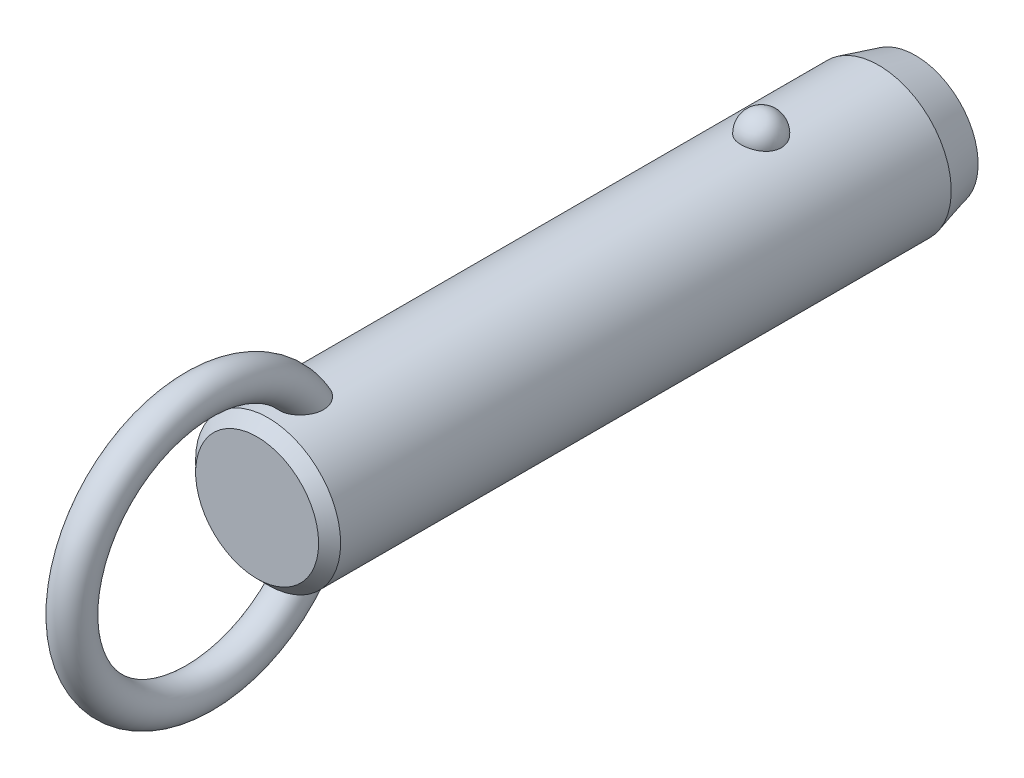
ISO-10303-21;
HEADER;
FILE_DESCRIPTION(('STEP AP214'),'2;1');
FILE_NAME('part.step','',(''),(''),'','','');
FILE_SCHEMA(('AUTOMOTIVE_DESIGN { 1 0 10303 214 1 1 1 1 }'));
ENDSEC;
DATA;
#1=APPLICATION_CONTEXT('core data for automotive mechanical design processes');
#2=APPLICATION_PROTOCOL_DEFINITION('international standard','automotive_design',2000,#1);
#3=PRODUCT_CONTEXT('',#1,'mechanical');
#4=PRODUCT('Part','Part','',(#3));
#5=PRODUCT_RELATED_PRODUCT_CATEGORY('part','',(#4));
#6=PRODUCT_DEFINITION_FORMATION('','',#4);
#7=PRODUCT_DEFINITION_CONTEXT('part definition',#1,'design');
#8=PRODUCT_DEFINITION('design','',#6,#7);
#9=PRODUCT_DEFINITION_SHAPE('','',#8);
#10=(LENGTH_UNIT() NAMED_UNIT(*) SI_UNIT(.MILLI.,.METRE.));
#11=(NAMED_UNIT(*) PLANE_ANGLE_UNIT() SI_UNIT($,.RADIAN.));
#12=(NAMED_UNIT(*) SI_UNIT($,.STERADIAN.) SOLID_ANGLE_UNIT());
#13=UNCERTAINTY_MEASURE_WITH_UNIT(LENGTH_MEASURE(1.E-05),#10,'distance_accuracy_value','');
#14=(GEOMETRIC_REPRESENTATION_CONTEXT(3) GLOBAL_UNCERTAINTY_ASSIGNED_CONTEXT((#13)) GLOBAL_UNIT_ASSIGNED_CONTEXT((#10,
#11,#12)) REPRESENTATION_CONTEXT('',''));
#15=CARTESIAN_POINT('',(0.,0.,0.));
#16=DIRECTION('',(0.,0.,1.));
#17=DIRECTION('',(1.,0.,0.));
#18=AXIS2_PLACEMENT_3D('',#15,#16,#17);
#19=CARTESIAN_POINT('',(0.,0.,43.2));
#20=DIRECTION('',(0.,0.,-1.));
#21=DIRECTION('',(-1.,0.,0.));
#22=AXIS2_PLACEMENT_3D('',#19,#20,#21);
#23=CYLINDRICAL_SURFACE('',#22,7.9);
#24=CARTESIAN_POINT('',(2.1785689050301,7.59367088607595,-2.2));
#25=CARTESIAN_POINT('',(2.17856679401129,7.59367269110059,-2.07701843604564));
#26=CARTESIAN_POINT('',(2.16853481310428,7.59657145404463,-1.95401006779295));
#27=CARTESIAN_POINT('',(2.12864689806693,7.607843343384,-1.71147811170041));
#28=CARTESIAN_POINT('',(2.09878338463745,7.61621856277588,-1.59195587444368));
#29=CARTESIAN_POINT('',(2.0199931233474,7.63749180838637,-1.35985638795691));
#30=CARTESIAN_POINT('',(1.97107475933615,7.6503878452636,-1.24727610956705));
#31=CARTESIAN_POINT('',(1.85539377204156,7.67926115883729,-1.03213234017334));
#32=CARTESIAN_POINT('',(1.78863158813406,7.69523835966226,-0.929568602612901));
#33=CARTESIAN_POINT('',(1.63856494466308,7.7285848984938,-0.736786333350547));
#34=CARTESIAN_POINT('',(1.55518140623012,7.7459606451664,-0.64663044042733));
#35=CARTESIAN_POINT('',(1.37422937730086,7.78009978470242,-0.481747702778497));
#36=CARTESIAN_POINT('',(1.27666086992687,7.79686317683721,-0.4070208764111));
#37=CARTESIAN_POINT('',(1.07024728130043,7.82786153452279,-0.275278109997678));
#38=CARTESIAN_POINT('',(0.961434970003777,7.84210353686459,-0.218212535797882));
#39=CARTESIAN_POINT('',(0.735351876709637,7.86652194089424,-0.123146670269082));
#40=CARTESIAN_POINT('',(0.618082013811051,7.87669878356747,-0.0851443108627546));
#41=CARTESIAN_POINT('',(0.380637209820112,7.89170521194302,-0.0298158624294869));
#42=CARTESIAN_POINT('',(0.260550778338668,7.89662650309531,-0.0121347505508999));
#43=CARTESIAN_POINT('',(0.0190117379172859,7.90090003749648,0.00324379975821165));
#44=CARTESIAN_POINT('',(-0.102440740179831,7.90025280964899,0.000943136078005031));
#45=CARTESIAN_POINT('',(-0.341452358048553,7.89351056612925,-0.0233955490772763));
#46=CARTESIAN_POINT('',(-0.459042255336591,7.88749257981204,-0.045154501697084));
#47=CARTESIAN_POINT('',(-0.688796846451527,7.87075812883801,-0.107408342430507));
#48=CARTESIAN_POINT('',(-0.800961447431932,7.86004158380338,-0.147903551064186));
#49=CARTESIAN_POINT('',(-1.01743634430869,7.83497131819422,-0.246799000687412));
#50=CARTESIAN_POINT('',(-1.12169791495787,7.82059709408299,-0.30530057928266));
#51=CARTESIAN_POINT('',(-1.31891765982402,7.78976470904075,-0.438549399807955));
#52=CARTESIAN_POINT('',(-1.41187469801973,7.77330633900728,-0.513298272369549));
#53=CARTESIAN_POINT('',(-1.58577142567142,7.73972434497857,-0.678622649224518));
#54=CARTESIAN_POINT('',(-1.66645140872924,7.72259402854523,-0.769470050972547));
#55=CARTESIAN_POINT('',(-1.81161503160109,7.68983776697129,-0.963538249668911));
#56=CARTESIAN_POINT('',(-1.87609753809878,7.6742119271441,-1.06675991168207));
#57=CARTESIAN_POINT('',(-1.98790138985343,7.6460202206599,-1.28401170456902));
#58=CARTESIAN_POINT('',(-2.03501994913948,7.63349104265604,-1.39815107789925));
#59=CARTESIAN_POINT('',(-2.10986724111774,7.6131449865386,-1.63301784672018));
#60=CARTESIAN_POINT('',(-2.1375965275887,7.60532797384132,-1.75374505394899));
#61=CARTESIAN_POINT('',(-2.17289256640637,7.59531950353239,-1.99782562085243));
#62=CARTESIAN_POINT('',(-2.18054294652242,7.59310471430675,-2.12116592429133));
#63=CARTESIAN_POINT('',(-2.17572919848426,7.59448538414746,-2.36741799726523));
#64=CARTESIAN_POINT('',(-2.1632656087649,7.59808068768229,-2.49032977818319));
#65=CARTESIAN_POINT('',(-2.11865035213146,7.61064035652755,-2.73161015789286));
#66=CARTESIAN_POINT('',(-2.08659579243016,7.61957823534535,-2.84999812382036));
#67=CARTESIAN_POINT('',(-2.00367799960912,7.64179982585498,-3.07955956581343));
#68=CARTESIAN_POINT('',(-1.9528140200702,7.65508371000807,-3.19073275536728));
#69=CARTESIAN_POINT('',(-1.83321113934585,7.68460381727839,-3.40337899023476));
#70=CARTESIAN_POINT('',(-1.76437735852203,7.70085556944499,-3.50479651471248));
#71=CARTESIAN_POINT('',(-1.61069526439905,7.73445734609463,-3.69446912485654));
#72=CARTESIAN_POINT('',(-1.52584634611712,7.75180741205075,-3.78272371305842));
#73=CARTESIAN_POINT('',(-1.34198059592,7.78574608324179,-3.94393987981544));
#74=CARTESIAN_POINT('',(-1.24291308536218,7.80233167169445,-4.01684434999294));
#75=CARTESIAN_POINT('',(-1.03352039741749,7.83281625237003,-4.14489386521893));
#76=CARTESIAN_POINT('',(-0.923196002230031,7.84671543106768,-4.20004014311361));
#77=CARTESIAN_POINT('',(-0.695822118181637,7.87011575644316,-4.29042017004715));
#78=CARTESIAN_POINT('',(-0.578872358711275,7.87966903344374,-4.32589112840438));
#79=CARTESIAN_POINT('',(-0.340410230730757,7.8935652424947,-4.37692226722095));
#80=CARTESIAN_POINT('',(-0.218898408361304,7.89790879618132,-4.39248482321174));
#81=CARTESIAN_POINT('',(0.0228107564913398,7.90087453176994,-4.40314405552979));
#82=CARTESIAN_POINT('',(0.142990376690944,7.89960185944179,-4.39861683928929));
#83=CARTESIAN_POINT('',(0.380829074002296,7.89171262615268,-4.37008293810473));
#84=CARTESIAN_POINT('',(0.498488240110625,7.8850962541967,-4.34607694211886));
#85=CARTESIAN_POINT('',(0.727535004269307,7.86726442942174,-4.27939317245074));
#86=CARTESIAN_POINT('',(0.838944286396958,7.85606616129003,-4.23678512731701));
#87=CARTESIAN_POINT('',(1.05295421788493,7.83025654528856,-4.13408348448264));
#88=CARTESIAN_POINT('',(1.15555431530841,7.81564498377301,-4.07398879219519));
#89=CARTESIAN_POINT('',(1.35076763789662,7.7843022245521,-3.93687432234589));
#90=CARTESIAN_POINT('',(1.4432046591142,7.76754209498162,-3.85961036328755));
#91=CARTESIAN_POINT('',(1.6139111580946,7.73387857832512,-3.69076949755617));
#92=CARTESIAN_POINT('',(1.6921781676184,7.71697516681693,-3.59919010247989));
#93=CARTESIAN_POINT('',(1.83380875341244,7.6845643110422,-3.40247278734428));
#94=CARTESIAN_POINT('',(1.89689280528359,7.66908588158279,-3.29712873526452));
#95=CARTESIAN_POINT('',(2.0047823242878,7.64159441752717,-3.07707931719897));
#96=CARTESIAN_POINT('',(2.0495945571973,7.62958010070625,-2.96237743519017));
#97=CARTESIAN_POINT('',(2.11580183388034,7.61146617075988,-2.74040519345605));
#98=CARTESIAN_POINT('',(2.13929812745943,7.60484503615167,-2.63379846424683));
#99=CARTESIAN_POINT('',(2.17068242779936,7.59594664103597,-2.41813481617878));
#100=CARTESIAN_POINT('',(2.17857077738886,7.59366928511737,-2.30907795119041));
#101=CARTESIAN_POINT('',(2.1785689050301,7.59367088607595,-2.2));
#102=B_SPLINE_CURVE_WITH_KNOTS('',3,(#24,#25,#26,#27,#28,#29,#30,#31,#32,#33,#34,#35,#36,#37,
#38,#39,#40,#41,#42,#43,#44,#45,#46,#47,#48,#49,#50,#51,#52,#53,#54,#55,#56,#57,#58,#59,#60,#61,
#62,#63,#64,#65,#66,#67,#68,#69,#70,#71,#72,#73,#74,#75,#76,#77,#78,#79,#80,#81,#82,#83,#84,#85,
#86,#87,#88,#89,#90,#91,#92,#93,#94,#95,#96,#97,#98,#99,#100,#101),.UNSPECIFIED.,.T.,.F.,(4,2,2,
2,2,2,2,2,2,2,2,2,2,2,2,2,2,2,2,2,2,2,2,2,2,2,2,2,2,2,2,2,2,2,2,2,2,2,4),(0.,0.368552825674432,
0.737246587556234,1.10577831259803,1.4743009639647,1.84462067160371,2.21494081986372,
2.5842105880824,2.95344028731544,3.31611630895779,3.67875788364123,4.03628044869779,
4.39380913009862,4.75338791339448,5.11300280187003,5.47939989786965,5.8458226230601,
6.21639834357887,6.58696347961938,6.95598276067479,7.32499216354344,7.69218715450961,
8.0593967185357,8.42858578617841,8.79778880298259,9.16834203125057,9.5388695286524,
9.90482699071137,10.2707407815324,10.6298333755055,10.9889132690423,11.3466585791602,
11.7044262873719,12.0676511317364,12.4309391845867,12.8004764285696,13.1698767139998,
13.4967701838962,13.8236564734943),.UNSPECIFIED.);
#103=CARTESIAN_POINT('',(2.1785689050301,7.59367088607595,-2.2));
#104=VERTEX_POINT('',#103);
#105=EDGE_CURVE('E41',#104,#104,#102,.T.);
#106=ORIENTED_EDGE('',*,*,#105,.T.);
#107=EDGE_LOOP('',(#106));
#108=FACE_BOUND('',#107,.T.);
#109=CARTESIAN_POINT('',(0.,0.,51.52));
#110=DIRECTION('',(0.,0.,1.));
#111=DIRECTION('',(1.,0.,0.));
#112=AXIS2_PLACEMENT_3D('',#109,#110,#111);
#113=CIRCLE('',#112,7.9);
#114=CARTESIAN_POINT('',(7.9,0.,51.52));
#115=VERTEX_POINT('',#114);
#116=EDGE_CURVE('E10',#115,#115,#113,.F.);
#117=ORIENTED_EDGE('',*,*,#116,.T.);
#118=EDGE_LOOP('',(#117));
#119=FACE_BOUND('',#118,.T.);
#120=CARTESIAN_POINT('',(-0.630969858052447,-7.87476203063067,45.4124322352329));
#121=CARTESIAN_POINT('',(-0.734180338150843,-7.8664899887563,45.447285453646));
#122=CARTESIAN_POINT('',(-0.83447695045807,-7.85639291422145,45.4908160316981));
#123=CARTESIAN_POINT('',(-1.0262035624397,-7.83366343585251,45.5940948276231));
#124=CARTESIAN_POINT('',(-1.1176141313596,-7.82102565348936,45.6538775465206));
#125=CARTESIAN_POINT('',(-1.28877277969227,-7.79464922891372,45.7878390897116));
#126=CARTESIAN_POINT('',(-1.36854014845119,-7.78091246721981,45.861993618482));
#127=CARTESIAN_POINT('',(-1.51461521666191,-7.75380398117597,46.0224941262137));
#128=CARTESIAN_POINT('',(-1.58092966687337,-7.74043207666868,46.1088339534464));
#129=CARTESIAN_POINT('',(-1.70019064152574,-7.71512522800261,46.2929784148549));
#130=CARTESIAN_POINT('',(-1.75284037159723,-7.70322473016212,46.3909792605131));
#131=CARTESIAN_POINT('',(-1.84263464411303,-7.68224112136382,46.5941029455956));
#132=CARTESIAN_POINT('',(-1.87977299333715,-7.6731591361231,46.6992286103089));
#133=CARTESIAN_POINT('',(-1.94152728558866,-7.65777930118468,46.9232849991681));
#134=CARTESIAN_POINT('',(-1.96475471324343,-7.65179654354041,47.0426167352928));
#135=CARTESIAN_POINT('',(-1.99449499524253,-7.64409642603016,47.2834298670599));
#136=CARTESIAN_POINT('',(-2.0010005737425,-7.64238092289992,47.4049121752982));
#137=CARTESIAN_POINT('',(-1.99856014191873,-7.64302120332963,47.6683409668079));
#138=CARTESIAN_POINT('',(-1.98680021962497,-7.64611845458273,47.8102565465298));
#139=CARTESIAN_POINT('',(-1.94457772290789,-7.65696186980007,48.0911188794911));
#140=CARTESIAN_POINT('',(-1.91409393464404,-7.66471330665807,48.2300620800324));
#141=CARTESIAN_POINT('',(-1.82768670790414,-7.68582947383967,48.5319397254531));
#142=CARTESIAN_POINT('',(-1.76772963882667,-7.70003779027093,48.693686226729));
#143=CARTESIAN_POINT('',(-1.65998501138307,-7.72371550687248,48.9276956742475));
#144=CARTESIAN_POINT('',(-1.621079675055,-7.73200670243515,49.0042974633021));
#145=CARTESIAN_POINT('',(-1.53727726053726,-7.74910377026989,49.1540798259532));
#146=CARTESIAN_POINT('',(-1.49238215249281,-7.75790947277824,49.2272615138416));
#147=CARTESIAN_POINT('',(-1.37397050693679,-7.77993338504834,49.4028838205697));
#148=CARTESIAN_POINT('',(-1.29690364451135,-7.79328473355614,49.5029557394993));
#149=CARTESIAN_POINT('',(-1.12885487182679,-7.81939266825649,49.6907147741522));
#150=CARTESIAN_POINT('',(-1.03789926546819,-7.83215032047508,49.7784247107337));
#151=CARTESIAN_POINT('',(-0.869532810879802,-7.85231710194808,49.9134148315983));
#152=CARTESIAN_POINT('',(-0.795716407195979,-7.86021093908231,49.965076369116));
#153=CARTESIAN_POINT('',(-0.640813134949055,-7.87434920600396,50.0563815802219));
#154=CARTESIAN_POINT('',(-0.559737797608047,-7.88059619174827,50.0960438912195));
#155=CARTESIAN_POINT('',(-0.406456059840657,-7.88984116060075,50.1543008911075));
#156=CARTESIAN_POINT('',(-0.335227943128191,-7.89321892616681,50.1753848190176));
#157=CARTESIAN_POINT('',(-0.190193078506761,-7.89804235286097,50.2054141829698));
#158=CARTESIAN_POINT('',(-0.116388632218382,-7.89948969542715,50.2143701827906));
#159=CARTESIAN_POINT('',(0.0318414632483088,-7.90028409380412,50.2192915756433));
#160=CARTESIAN_POINT('',(0.106268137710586,-7.89962640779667,50.2152276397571));
#161=CARTESIAN_POINT('',(0.25329066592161,-7.8962818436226,50.1944615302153));
#162=CARTESIAN_POINT('',(0.325885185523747,-7.8935935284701,50.1777504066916));
#163=CARTESIAN_POINT('',(0.48144171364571,-7.88577340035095,50.1287380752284));
#164=CARTESIAN_POINT('',(0.563611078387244,-7.88026321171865,50.094005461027));
#165=CARTESIAN_POINT('',(0.721129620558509,-7.86741729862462,50.0117965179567));
#166=CARTESIAN_POINT('',(0.796466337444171,-7.86007832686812,49.9642975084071));
#167=CARTESIAN_POINT('',(0.97145628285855,-7.84073285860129,49.836513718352));
#168=CARTESIAN_POINT('',(1.06719686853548,-7.82809461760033,49.7510047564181));
#169=CARTESIAN_POINT('',(1.24418921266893,-7.80192439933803,49.566232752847));
#170=CARTESIAN_POINT('',(1.32540832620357,-7.78839049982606,49.4669395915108));
#171=CARTESIAN_POINT('',(1.45199971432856,-7.76559693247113,49.2895760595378));
#172=CARTESIAN_POINT('',(1.50085649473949,-7.75626094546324,49.2139542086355));
#173=CARTESIAN_POINT('',(1.59197749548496,-7.7380727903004,49.0587428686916));
#174=CARTESIAN_POINT('',(1.63423919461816,-7.72922080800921,48.9791518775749));
#175=CARTESIAN_POINT('',(1.71222612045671,-7.71231959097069,48.8166640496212));
#176=CARTESIAN_POINT('',(1.74794516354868,-7.70427111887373,48.733764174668));
#177=CARTESIAN_POINT('',(1.81270113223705,-7.68929240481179,48.5652967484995));
#178=CARTESIAN_POINT('',(1.84173789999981,-7.68236218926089,48.4797291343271));
#179=CARTESIAN_POINT('',(1.89322698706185,-7.6698375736,48.3052870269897));
#180=CARTESIAN_POINT('',(1.91558744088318,-7.66426199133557,48.2163838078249));
#181=CARTESIAN_POINT('',(1.95281367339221,-7.65485915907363,48.0369696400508));
#182=CARTESIAN_POINT('',(1.96767946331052,-7.65103190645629,47.9464586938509));
#183=CARTESIAN_POINT('',(2.0002145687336,-7.64262981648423,47.6737320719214));
#184=CARTESIAN_POINT('',(2.00600691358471,-7.6410871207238,47.4897099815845));
#185=CARTESIAN_POINT('',(1.98445334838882,-7.64669564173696,47.1765019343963));
#186=CARTESIAN_POINT('',(1.96607186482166,-7.65149688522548,47.046618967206));
#187=CARTESIAN_POINT('',(1.90884967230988,-7.66597624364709,46.7916321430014));
#188=CARTESIAN_POINT('',(1.87002101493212,-7.67565148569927,46.666525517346));
#189=CARTESIAN_POINT('',(1.77063986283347,-7.69918471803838,46.4245401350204));
#190=CARTESIAN_POINT('',(1.70993724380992,-7.71307150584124,46.3077250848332));
#191=CARTESIAN_POINT('',(1.56733070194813,-7.74330306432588,46.0881444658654));
#192=CARTESIAN_POINT('',(1.48543692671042,-7.75964665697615,45.9853722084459));
#193=CARTESIAN_POINT('',(1.31346177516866,-7.79047523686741,45.8093800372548));
#194=CARTESIAN_POINT('',(1.22547278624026,-7.80495298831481,45.7341066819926));
#195=CARTESIAN_POINT('',(1.0372435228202,-7.83218597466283,45.6004864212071));
#196=CARTESIAN_POINT('',(0.937008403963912,-7.84494192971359,45.5421324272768));
#197=CARTESIAN_POINT('',(0.733599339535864,-7.86649045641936,45.4470270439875));
#198=CARTESIAN_POINT('',(0.630941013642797,-7.87547134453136,45.4092109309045));
#199=CARTESIAN_POINT('',(0.420465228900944,-7.88950708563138,45.3511160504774));
#200=CARTESIAN_POINT('',(0.312645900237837,-7.89456050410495,45.3308436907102));
#201=CARTESIAN_POINT('',(0.0960869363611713,-7.9001518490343,45.3084559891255));
#202=CARTESIAN_POINT('',(-0.0126341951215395,-7.90073226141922,45.3061698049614));
#203=CARTESIAN_POINT('',(-0.228766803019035,-7.89742350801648,45.3193678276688));
#204=CARTESIAN_POINT('',(-0.336180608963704,-7.89354403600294,45.3348134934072));
#205=CARTESIAN_POINT('',(-0.473410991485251,-7.88586871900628,45.3662177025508));
#206=CARTESIAN_POINT('',(-0.505257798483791,-7.88388984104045,45.3743541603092));
#207=CARTESIAN_POINT('',(-0.568481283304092,-7.87958326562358,45.3922083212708));
#208=CARTESIAN_POINT('',(-0.599857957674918,-7.87725556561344,45.4019260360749));
#209=CARTESIAN_POINT('',(-0.630969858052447,-7.87476203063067,45.4124322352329));
#210=B_SPLINE_CURVE_WITH_KNOTS('',3,(#120,#121,#122,#123,#124,#125,#126,#127,#128,#129,#130,
#131,#132,#133,#134,#135,#136,#137,#138,#139,#140,#141,#142,#143,#144,#145,#146,#147,#148,#149,
#150,#151,#152,#153,#154,#155,#156,#157,#158,#159,#160,#161,#162,#163,#164,#165,#166,#167,#168,
#169,#170,#171,#172,#173,#174,#175,#176,#177,#178,#179,#180,#181,#182,#183,#184,#185,#186,#187,
#188,#189,#190,#191,#192,#193,#194,#195,#196,#197,#198,#199,#200,#201,#202,#203,#204,#205,#206,
#207,#208,#209),.UNSPECIFIED.,.T.,.F.,(4,2,2,2,2,2,2,2,2,2,2,2,2,2,2,2,2,2,2,2,2,2,2,2,2,2,2,2,
2,2,2,2,2,2,2,2,2,2,2,2,2,2,2,2,4),(0.,0.327622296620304,0.655945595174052,0.983718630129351,
1.3113267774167,1.64554655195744,1.97989964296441,2.34365728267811,2.70757317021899,
3.13333684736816,3.55958380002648,4.07655306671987,4.3352789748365,4.593919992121,
4.9738243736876,5.35301797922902,5.62348245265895,5.89352465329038,6.11565959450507,
6.3376009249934,6.56004255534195,6.782641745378,7.04930844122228,7.31645206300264,
7.70130871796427,8.08701995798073,8.35824509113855,8.62957365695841,8.90115735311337,
9.17274746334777,9.44791855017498,9.72308922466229,10.2715298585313,10.6638393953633,
11.0559179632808,11.4507403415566,11.8453740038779,12.1936425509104,12.5417649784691,
12.8695063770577,13.1973674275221,13.5221104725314,13.8461490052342,13.9449071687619,
14.0436660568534),.UNSPECIFIED.);
#211=CARTESIAN_POINT('',(-0.630969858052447,-7.87476203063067,45.4124322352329));
#212=VERTEX_POINT('',#211);
#213=EDGE_CURVE('E60',#212,#212,#210,.T.);
#214=ORIENTED_EDGE('',*,*,#213,.T.);
#215=EDGE_LOOP('',(#214));
#216=FACE_BOUND('',#215,.T.);
#217=CARTESIAN_POINT('',(-0.630969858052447,7.87476203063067,45.4124322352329));
#218=CARTESIAN_POINT('',(-0.528918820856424,7.88293636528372,45.3779798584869));
#219=CARTESIAN_POINT('',(-0.423745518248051,7.8893481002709,45.351915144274));
#220=CARTESIAN_POINT('',(-0.210236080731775,7.8979273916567,45.3172825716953));
#221=CARTESIAN_POINT('',(-0.101893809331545,7.90008607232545,45.3087513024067));
#222=CARTESIAN_POINT('',(0.114660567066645,7.89990877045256,45.3094570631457));
#223=CARTESIAN_POINT('',(0.22287270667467,7.89757640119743,45.3186798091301));
#224=CARTESIAN_POINT('',(0.436107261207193,7.88867538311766,45.3546525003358));
#225=CARTESIAN_POINT('',(0.541131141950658,7.8821087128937,45.3813942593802));
#226=CARTESIAN_POINT('',(0.745085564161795,7.86545130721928,45.4517561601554));
#227=CARTESIAN_POINT('',(0.844015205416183,7.85536005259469,45.4953787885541));
#228=CARTESIAN_POINT('',(1.03299167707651,7.83275153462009,45.5983796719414));
#229=CARTESIAN_POINT('',(1.12303841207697,7.8202342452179,45.6577580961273));
#230=CARTESIAN_POINT('',(1.29214734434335,7.79408219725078,45.7908647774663));
#231=CARTESIAN_POINT('',(1.37116907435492,7.78044359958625,45.8646436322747));
#232=CARTESIAN_POINT('',(1.51597677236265,7.75353170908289,46.0242353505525));
#233=CARTESIAN_POINT('',(1.58176261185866,7.74025841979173,46.1100483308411));
#234=CARTESIAN_POINT('',(1.70057386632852,7.71504069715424,46.293644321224));
#235=CARTESIAN_POINT('',(1.75320073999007,7.7031425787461,46.3916906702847));
#236=CARTESIAN_POINT('',(1.84293767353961,7.68216822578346,46.5948931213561));
#237=CARTESIAN_POINT('',(1.88004278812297,7.67309289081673,46.7000514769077));
#238=CARTESIAN_POINT('',(1.9417232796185,7.6577294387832,46.9241671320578));
#239=CARTESIAN_POINT('',(1.96491037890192,7.65175648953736,47.0435248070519));
#240=CARTESIAN_POINT('',(1.9945689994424,7.64407702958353,47.2843848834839));
#241=CARTESIAN_POINT('',(2.00103304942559,7.64237242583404,47.4058882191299));
#242=CARTESIAN_POINT('',(1.99850166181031,7.64303650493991,47.6693688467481));
#243=CARTESIAN_POINT('',(1.98669038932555,7.64614714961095,47.8113141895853));
#244=CARTESIAN_POINT('',(1.94436120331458,7.6570170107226,48.0922287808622));
#245=CARTESIAN_POINT('',(1.91382203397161,7.66478150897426,48.2311944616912));
#246=CARTESIAN_POINT('',(1.82728754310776,7.68592483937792,48.5331110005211));
#247=CARTESIAN_POINT('',(1.76725778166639,7.7001468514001,48.694872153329));
#248=CARTESIAN_POINT('',(1.65939700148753,7.72384204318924,48.9288914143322));
#249=CARTESIAN_POINT('',(1.62045187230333,7.73213852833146,49.0054942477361));
#250=CARTESIAN_POINT('',(1.5365668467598,7.74924489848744,49.1552737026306));
#251=CARTESIAN_POINT('',(1.49162892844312,7.75805461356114,49.2284514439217));
#252=CARTESIAN_POINT('',(1.37317698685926,7.78007342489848,49.4039520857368));
#253=CARTESIAN_POINT('',(1.29612360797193,7.79341423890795,49.5039112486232));
#254=CARTESIAN_POINT('',(1.12812043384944,7.81949839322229,49.6914508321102));
#255=CARTESIAN_POINT('',(1.03719688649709,7.83224280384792,49.7790540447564));
#256=CARTESIAN_POINT('',(0.868871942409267,7.85239026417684,49.9138971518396));
#257=CARTESIAN_POINT('',(0.795056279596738,7.86027769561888,49.9655113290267));
#258=CARTESIAN_POINT('',(0.640160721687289,7.87440222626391,50.0567201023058));
#259=CARTESIAN_POINT('',(0.559092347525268,7.88064188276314,50.0963333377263));
#260=CARTESIAN_POINT('',(0.40582092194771,7.8898738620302,50.1545056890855));
#261=CARTESIAN_POINT('',(0.334594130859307,7.89324577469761,50.1755523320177));
#262=CARTESIAN_POINT('',(0.189568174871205,7.89805733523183,50.2055070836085));
#263=CARTESIAN_POINT('',(0.115771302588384,7.89949866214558,50.2144257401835));
#264=CARTESIAN_POINT('',(-0.0324359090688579,7.90028156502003,50.2192758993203));
#265=CARTESIAN_POINT('',(-0.106847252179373,7.89961843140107,50.2151782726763));
#266=CARTESIAN_POINT('',(-0.253834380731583,7.8962642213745,50.1943519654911));
#267=CARTESIAN_POINT('',(-0.326408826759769,7.89357170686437,50.1776143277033));
#268=CARTESIAN_POINT('',(-0.481962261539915,7.88574179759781,50.1285391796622));
#269=CARTESIAN_POINT('',(-0.564145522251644,7.88022507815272,50.0937638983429));
#270=CARTESIAN_POINT('',(-0.72168526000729,7.86736646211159,50.0114686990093));
#271=CARTESIAN_POINT('',(-0.797029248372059,7.8600213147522,49.9639260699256));
#272=CARTESIAN_POINT('',(-0.9720442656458,7.84066026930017,49.8360267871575));
#273=CARTESIAN_POINT('',(-1.06779803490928,7.82801274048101,49.7504436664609));
#274=CARTESIAN_POINT('',(-1.2448053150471,7.80182621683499,49.5655223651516));
#275=CARTESIAN_POINT('',(-1.32602618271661,7.78828530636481,49.4661540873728));
#276=CARTESIAN_POINT('',(-1.45259834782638,7.76548487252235,49.2886806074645));
#277=CARTESIAN_POINT('',(-1.50143856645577,7.75614818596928,49.2130252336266));
#278=CARTESIAN_POINT('',(-1.59252410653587,7.73796020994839,49.0577484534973));
#279=CARTESIAN_POINT('',(-1.63476690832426,7.72910910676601,48.9781255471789));
#280=CARTESIAN_POINT('',(-1.71271318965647,7.71221133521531,48.8155750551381));
#281=CARTESIAN_POINT('',(-1.7484104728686,7.70416543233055,48.7326444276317));
#282=CARTESIAN_POINT('',(-1.81311929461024,7.6891937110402,48.5641168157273));
#283=CARTESIAN_POINT('',(-1.84213067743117,7.6822679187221,48.4785197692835));
#284=CARTESIAN_POINT('',(-1.89356259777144,7.66975461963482,48.3040254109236));
#285=CARTESIAN_POINT('',(-1.91589165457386,7.66418586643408,48.2150995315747));
#286=CARTESIAN_POINT('',(-1.95305070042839,7.65479859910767,48.0356424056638));
#287=CARTESIAN_POINT('',(-1.96788069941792,7.65098008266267,47.9451111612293));
#288=CARTESIAN_POINT('',(-2.00030078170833,7.64260704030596,47.6723270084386));
#289=CARTESIAN_POINT('',(-2.00600576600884,7.64108760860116,47.4882718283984));
#290=CARTESIAN_POINT('',(-1.98428483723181,7.64673945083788,47.1750800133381));
#291=CARTESIAN_POINT('',(-1.96583698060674,7.65155751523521,47.0452400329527));
#292=CARTESIAN_POINT('',(-1.90848948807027,7.66606613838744,46.7903619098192));
#293=CARTESIAN_POINT('',(-1.86960376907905,7.67575338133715,46.665320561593));
#294=CARTESIAN_POINT('',(-1.77013421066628,7.6993013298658,46.4235009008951));
#295=CARTESIAN_POINT('',(-1.70940488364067,7.71318991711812,46.3067844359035));
#296=CARTESIAN_POINT('',(-1.56672953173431,7.74342495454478,46.0873404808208));
#297=CARTESIAN_POINT('',(-1.48478316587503,7.75977144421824,45.9846132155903));
#298=CARTESIAN_POINT('',(-1.31266325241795,7.79061163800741,45.808643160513));
#299=CARTESIAN_POINT('',(-1.22456383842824,7.80509908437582,45.7333589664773));
#300=CARTESIAN_POINT('',(-1.0362240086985,7.83231881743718,45.5998659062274));
#301=CARTESIAN_POINT('',(-0.936015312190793,7.84505551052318,45.5416137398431));
#302=CARTESIAN_POINT('',(-0.798824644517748,7.85957802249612,45.4775408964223));
#303=CARTESIAN_POINT('',(-0.765787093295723,7.86286821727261,45.4632248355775));
#304=CARTESIAN_POINT('',(-0.698939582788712,7.86909211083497,45.436436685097));
#305=CARTESIAN_POINT('',(-0.665129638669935,7.8720258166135,45.4239645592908));
#306=CARTESIAN_POINT('',(-0.630969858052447,7.87476203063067,45.4124322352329));
#307=B_SPLINE_CURVE_WITH_KNOTS('',3,(#217,#218,#219,#220,#221,#222,#223,#224,#225,#226,#227,
#228,#229,#230,#231,#232,#233,#234,#235,#236,#237,#238,#239,#240,#241,#242,#243,#244,#245,#246,
#247,#248,#249,#250,#251,#252,#253,#254,#255,#256,#257,#258,#259,#260,#261,#262,#263,#264,#265,
#266,#267,#268,#269,#270,#271,#272,#273,#274,#275,#276,#277,#278,#279,#280,#281,#282,#283,#284,
#285,#286,#287,#288,#289,#290,#291,#292,#293,#294,#295,#296,#297,#298,#299,#300,#301,#302,#303,
#304,#305,#306),.UNSPECIFIED.,.T.,.F.,(4,2,2,2,2,2,2,2,2,2,2,2,2,2,2,2,2,2,2,2,2,2,2,2,2,2,2,2,
2,2,2,2,2,2,2,2,2,2,2,2,2,2,2,2,4),(0.,0.32392037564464,0.64851603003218,0.972850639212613,
1.29703380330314,1.62126473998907,1.94549915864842,2.27089401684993,2.59629203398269,
2.93059633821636,3.26500707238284,3.6288164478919,3.99278833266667,4.41865421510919,
4.84500434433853,5.36209210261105,5.62087589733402,5.87957448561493,6.25918598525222,
6.63808782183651,6.90846748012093,7.17842501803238,7.40052350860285,7.62242871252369,
7.84483086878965,8.0673907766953,8.33414615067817,8.60137921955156,8.98641454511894,
9.37230415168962,9.64358673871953,9.91497268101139,10.1866142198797,10.4582620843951,
10.7334745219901,11.008686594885,11.5572126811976,11.9494246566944,12.3413699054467,
12.7359755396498,13.1305875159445,13.4791770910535,13.82687259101,13.9353013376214,
14.0437279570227),.UNSPECIFIED.);
#308=CARTESIAN_POINT('',(-0.630969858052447,7.87476203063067,45.4124322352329));
#309=VERTEX_POINT('',#308);
#310=EDGE_CURVE('E67',#309,#309,#307,.T.);
#311=ORIENTED_EDGE('',*,*,#310,.T.);
#312=EDGE_LOOP('',(#311));
#313=FACE_BOUND('',#312,.T.);
#314=CARTESIAN_POINT('',(0.,0.,-15.));
#315=DIRECTION('',(0.,0.,-1.));
#316=DIRECTION('',(-1.,0.,0.));
#317=AXIS2_PLACEMENT_3D('',#314,#315,#316);
#318=CIRCLE('',#317,7.9);
#319=CARTESIAN_POINT('',(-7.9,0.,-15.));
#320=VERTEX_POINT('',#319);
#321=EDGE_CURVE('E57',#320,#320,#318,.F.);
#322=ORIENTED_EDGE('',*,*,#321,.T.);
#323=EDGE_LOOP('',(#322));
#324=FACE_BOUND('',#323,.T.);
#325=ADVANCED_FACE('F37',(#108,#119,#216,#313,#324),#23,.T.);
#326=CARTESIAN_POINT('',(0.,0.,-19.));
#327=DIRECTION('',(0.,0.,-1.));
#328=DIRECTION('',(-1.,0.,0.));
#329=AXIS2_PLACEMENT_3D('',#326,#327,#328);
#330=PLANE('',#329);
#331=CARTESIAN_POINT('',(0.,0.,-19.));
#332=DIRECTION('',(0.,0.,-1.));
#333=DIRECTION('',(-1.,0.,0.));
#334=AXIS2_PLACEMENT_3D('',#331,#332,#333);
#335=CIRCLE('',#334,6.82820323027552);
#336=CARTESIAN_POINT('',(-6.82820323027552,0.,-19.));
#337=VERTEX_POINT('',#336);
#338=EDGE_CURVE('E66',#337,#337,#335,.T.);
#339=ORIENTED_EDGE('',*,*,#338,.T.);
#340=EDGE_LOOP('',(#339));
#341=FACE_BOUND('',#340,.T.);
#342=ADVANCED_FACE('F85',(#341),#330,.T.);
#343=CARTESIAN_POINT('',(0.,0.,-19.));
#344=DIRECTION('',(0.,0.,1.));
#345=DIRECTION('',(1.,0.,0.));
#346=AXIS2_PLACEMENT_3D('',#343,#344,#345);
#347=CONICAL_SURFACE('',#346,6.82820323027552,0.261799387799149);
#348=ORIENTED_EDGE('',*,*,#321,.F.);
#349=EDGE_LOOP('',(#348));
#350=FACE_BOUND('',#349,.T.);
#351=ORIENTED_EDGE('',*,*,#338,.F.);
#352=EDGE_LOOP('',(#351));
#353=FACE_BOUND('',#352,.T.);
#354=ADVANCED_FACE('F83',(#350,#353),#347,.T.);
#355=CARTESIAN_POINT('',(0.,0.,52.72));
#356=DIRECTION('',(0.,0.,1.));
#357=DIRECTION('',(1.,0.,0.));
#358=AXIS2_PLACEMENT_3D('',#355,#356,#357);
#359=PLANE('',#358);
#360=CARTESIAN_POINT('',(0.,0.,52.72));
#361=DIRECTION('',(0.,0.,1.));
#362=DIRECTION('',(1.,0.,0.));
#363=AXIS2_PLACEMENT_3D('',#360,#361,#362);
#364=CIRCLE('',#363,6.70000000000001);
#365=CARTESIAN_POINT('',(6.70000000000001,0.,52.72));
#366=VERTEX_POINT('',#365);
#367=EDGE_CURVE('E50',#366,#366,#364,.T.);
#368=ORIENTED_EDGE('',*,*,#367,.T.);
#369=EDGE_LOOP('',(#368));
#370=FACE_BOUND('',#369,.T.);
#371=ADVANCED_FACE('F77',(#370),#359,.T.);
#372=CARTESIAN_POINT('',(0.,0.,59.05));
#373=DIRECTION('',(1.,0.,0.));
#374=DIRECTION('',(0.,0.,-1.));
#375=AXIS2_PLACEMENT_3D('',#372,#373,#374);
#376=TOROIDAL_SURFACE('',#375,13.85,2.);
#377=ORIENTED_EDGE('',*,*,#310,.F.);
#378=EDGE_LOOP('',(#377));
#379=FACE_BOUND('',#378,.T.);
#380=ORIENTED_EDGE('',*,*,#213,.F.);
#381=EDGE_LOOP('',(#380));
#382=FACE_BOUND('',#381,.T.);
#383=ADVANCED_FACE('F73',(#379,#382),#376,.T.);
#384=CARTESIAN_POINT('',(0.,0.,52.72));
#385=DIRECTION('',(0.,0.,-1.));
#386=DIRECTION('',(-1.,0.,0.));
#387=AXIS2_PLACEMENT_3D('',#384,#385,#386);
#388=CONICAL_SURFACE('',#387,6.70000000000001,0.785398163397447);
#389=ORIENTED_EDGE('',*,*,#116,.F.);
#390=EDGE_LOOP('',(#389));
#391=FACE_BOUND('',#390,.T.);
#392=ORIENTED_EDGE('',*,*,#367,.F.);
#393=EDGE_LOOP('',(#392));
#394=FACE_BOUND('',#393,.T.);
#395=ADVANCED_FACE('F39',(#391,#394),#388,.T.);
#396=CARTESIAN_POINT('',(0.,7.9,-2.2));
#397=DIRECTION('',(0.,1.,0.));
#398=DIRECTION('',(0.,0.,-1.));
#399=AXIS2_PLACEMENT_3D('',#396,#397,#398);
#400=SPHERICAL_SURFACE('',#399,2.2);
#401=ORIENTED_EDGE('',*,*,#105,.F.);
#402=EDGE_LOOP('',(#401));
#403=FACE_BOUND('',#402,.T.);
#404=ADVANCED_FACE('F79',(#403),#400,.T.);
#405=CLOSED_SHELL('',(#325,#342,#354,#371,#383,#395,#404));
#406=MANIFOLD_SOLID_BREP('B2',#405);
#407=ADVANCED_BREP_SHAPE_REPRESENTATION('',(#18,#406),#14);
#408=SHAPE_DEFINITION_REPRESENTATION(#9,#407);
ENDSEC;
END-ISO-10303-21;
